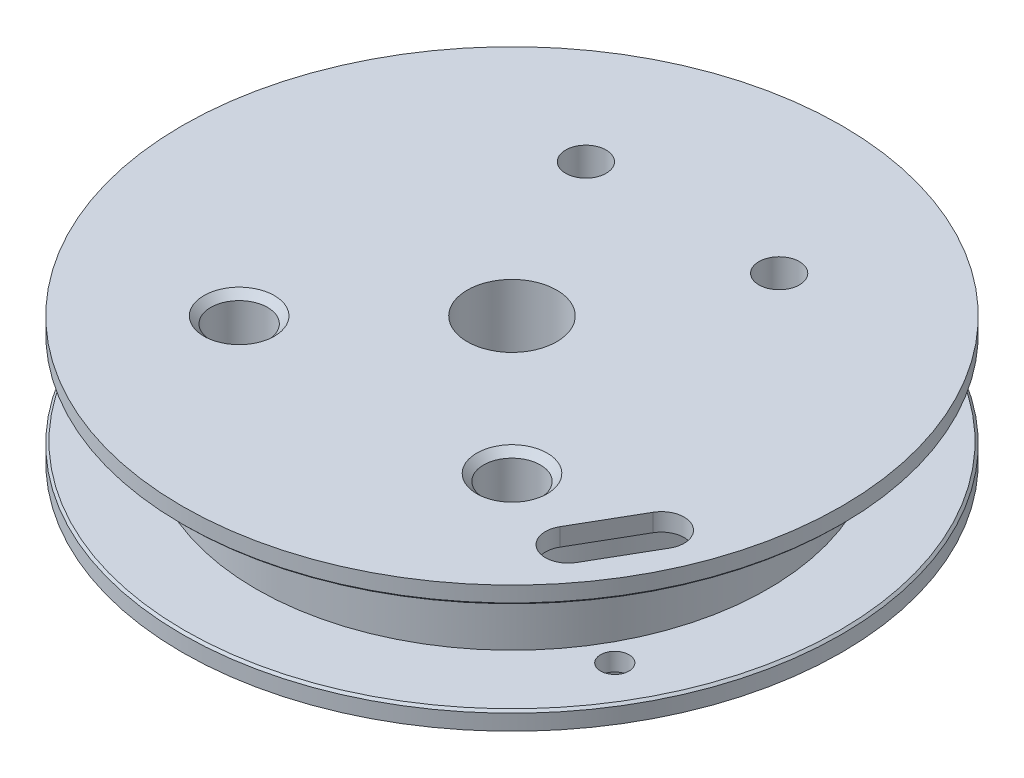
from build123d import *

# Parameters (mm, degrees)
SKETCH7_R                        = 0.79375
CUT_EXTRUDE2_DEPTH               = 2.54
F_1_8_0_125_DIAMETER_HOLE1_D     = 3.175
F_1_8_0_125_DIAMETER_HOLE1_DEPTH = 5.08
F_1_8_0_125_DIAMETER_HOLE1_TIP   = 0.953866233
F_4_40_TAPPED_HOLE1_D            = 2.2606
F_4_40_TAPPED_HOLE1_DEPTH        = 5.715
F_4_40_TAPPED_HOLE1_TIP          = 0.679152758
CUT_EXTRUDE4_REACH               = 31.139
CHAMFER1_SIZE                    = 0.127
CHAMFER2_SIZE                    = 0.381
CUT_EXTRUDE1_REACH               = 46.485
CUT_EXTRUDE1_END_RADIUS          = 9.525
SKETCH2_R                        = 0.635
SKETCH19_W                       = 2.0193
SKETCH19_H                       = 18.415


with BuildPart() as part:
    # Sketch1 → Revolve1 (revolve)
    with BuildSketch(Plane.XY, mode=Mode.PRIVATE) as revolve1_sk:
        Polygon((-2.5, 22.99396), (-9.525, 22.99396), (-9.525, 28.99396), (-18.415, 28.99396), (-18.415, 29.99396), (-14.2875, 29.99396), (-14.2875, 35.07396), (-18.415, 35.07396), (-18.415, 36.06456), (-2.5, 36.06456), (-2.5, 35.07396), align=None)
    revolve(revolve1_sk.sketch.rotate(Axis((0, 0, 0), (0, 1, 0)), 270), axis=Axis((0, 0, 0), (0, 1, 0)))

    # Sketch7 → Cut-Extrude2 (cut)
    with BuildSketch(Plane(origin=(0, 29.99396, 0), x_dir=(1, 0, 0), z_dir=(0, 1, 0))):
        with Locations(Location((13.583175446, -7.84225, 0), (0, 0, 270))):
            Circle(SKETCH7_R)
    extrude(amount=-CUT_EXTRUDE2_DEPTH, mode=Mode.SUBTRACT)

    # 1_8 _0.125_ Diameter Hole1
    with Locations(Plane(origin=(0, 36.06456, 0), x_dir=(1, 0, 0), z_dir=(0, 1, 0))):
        with Locations((-7.62, -7.62), (7.62, -7.62)):
            Hole(F_1_8_0_125_DIAMETER_HOLE1_D / 2, depth=F_1_8_0_125_DIAMETER_HOLE1_DEPTH)
            with Locations((0, 0, -(F_1_8_0_125_DIAMETER_HOLE1_DEPTH + F_1_8_0_125_DIAMETER_HOLE1_TIP / 2))):  # 118° drill point
                Cone(0, F_1_8_0_125_DIAMETER_HOLE1_D / 2, F_1_8_0_125_DIAMETER_HOLE1_TIP, mode=Mode.SUBTRACT)

    # 4-40 Tapped Hole1
    with Locations(Plane(origin=(0, 36.06456, 0), x_dir=(1, 0, 0), z_dir=(0, 1, 0))):
        with Locations((5.3975, 9.525), (-5.3975, 9.525)):
            Hole(F_4_40_TAPPED_HOLE1_D / 2, depth=F_4_40_TAPPED_HOLE1_DEPTH)
            with Locations((0, 0, -(F_4_40_TAPPED_HOLE1_DEPTH + F_4_40_TAPPED_HOLE1_TIP / 2))):  # 118° drill point
                Cone(0, F_4_40_TAPPED_HOLE1_D / 2, F_4_40_TAPPED_HOLE1_TIP, mode=Mode.SUBTRACT)

    # Sketch14 → Cut-Extrude4 (cut, up to next)
    with BuildSketch(Plane(origin=(0, 36.06456, 0), x_dir=(1, 0, 0), z_dir=(0, 1, 0)), mode=Mode.PRIVATE) as cut_extrude4_sk1:
        with BuildLine():
            Line((15.635527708, -6.827471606), (13.730527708, -10.127028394))
            ThreePointArc((13.730527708, -10.127028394), (11.995675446, -10.591880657), (11.530823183, -8.857028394))
            Line((11.530823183, -8.857028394), (13.435823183, -5.557471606))
            ThreePointArc((13.435823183, -5.557471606), (15.170675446, -5.092619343), (15.635527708, -6.827471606))
        make_face()
    cut_extrude4_tool1 = extrude(cut_extrude4_sk1.sketch, amount=-CUT_EXTRUDE4_REACH, mode=Mode.PRIVATE) & part.part
    add(cut_extrude4_tool1.solids().sort_by_distance((13.583175, 36.06456, 7.84225))[0], mode=Mode.SUBTRACT)

    # Chamfer1
    chamfer1_edges = [part.edges().sort_by_distance(p)[0] for p in [
        (0, 29.99396, 18.415),
        (0, 35.07396, 18.415),
    ]]
    chamfer(chamfer1_edges, length=CHAMFER1_SIZE)

    # Chamfer2
    chamfer2_edges = [part.edges().sort_by_distance(p)[0] for p in [
        (9.2075, 36.06456, 7.62),
        (-6.0325, 36.06456, 7.62),
    ]]
    chamfer(chamfer2_edges, length=CHAMFER2_SIZE)

    # Cut-Extrude1: up to this cylinder (the profile starts inside it)
    cut_extrude1_end = Plane(origin=(0, 25.99396, 0), z_dir=(0, -1, 0)) * Cylinder(CUT_EXTRUDE1_END_RADIUS, 113.02, mode=Mode.PRIVATE)
    # Sketch2 → Cut-Extrude1 (cut, up to the surface)
    with BuildSketch(Plane.XY, mode=Mode.PRIVATE) as cut_extrude1_sk1:
        with Locations(Location((0, 25.99396, 0), (0, 0, 180))):
            Circle(SKETCH2_R)
    cut_extrude1_tool1 = extrude(cut_extrude1_sk1.sketch, amount=CUT_EXTRUDE1_REACH, mode=Mode.PRIVATE) & cut_extrude1_end
    add(cut_extrude1_tool1.solids().sort_by_distance((0, 25.99396, 0))[0], mode=Mode.SUBTRACT)

    # Sketch19 → 10-32 Tapped Hole1 (revolve, cut)
    with BuildSketch(Plane(origin=(0, 25.99396, 0), x_dir=(0, 1, 0), z_dir=(1, 0, 0))):
        with Locations((1.00965, 9.2075)):
            Rectangle(SKETCH19_W, SKETCH19_H)
    revolve(axis=Axis((0, 25.99396, -6.35), (0, 0, 1)), mode=Mode.SUBTRACT)


solid = part.part
